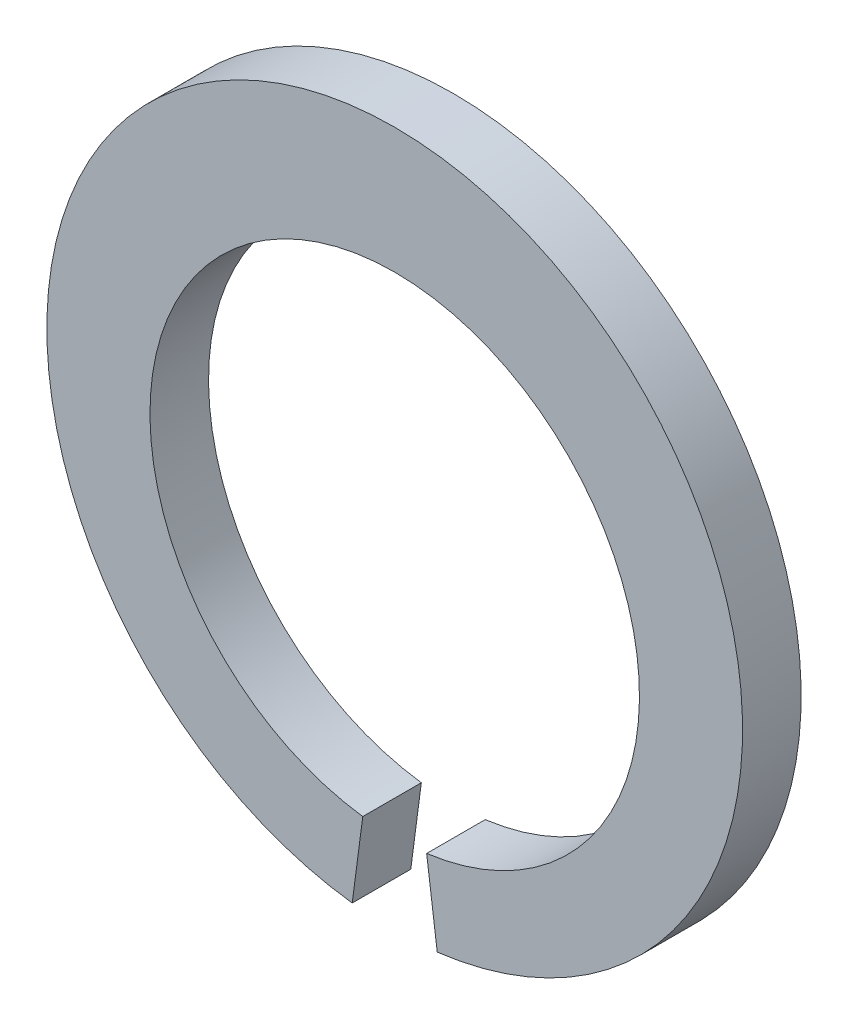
from build123d import *

# Parameters (mm, degrees)
BODY_DEPTH = 1.0668


with BuildPart() as part:
    # BodySke → Body (new body)
    with BuildSketch(Plane.XY):
        with BuildLine():
            Line((0.581846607, -4.419563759), (0.774137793, -5.880160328))
            ThreePointArc((0.774137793, -5.880160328), (0, 6.7437), (-0.774137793, -5.880160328))
            Line((-0.774137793, -5.880160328), (-0.581846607, -4.419563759))
            ThreePointArc((-0.581846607, -4.419563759), (0, 4.4577), (0.581846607, -4.419563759))
        make_face()
    extrude(amount=-BODY_DEPTH)


solid = part.part
